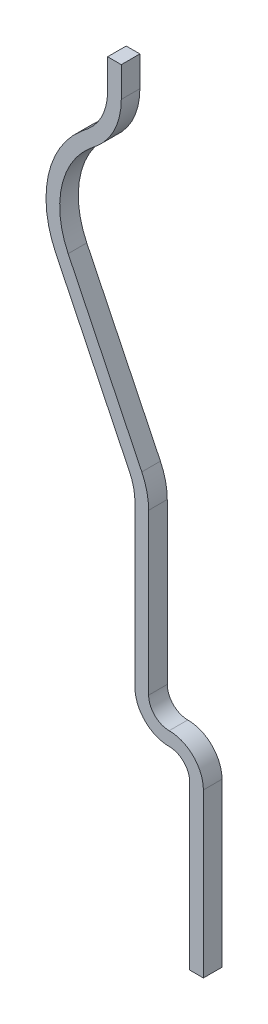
from build123d import *

# Parameters (mm, degrees)
PIN_EXTERNAL_BEND_DEPTH = 0.34


with BuildPart() as part:
    # Sketch1 → Pin External Bend (new body)
    with BuildSketch(Plane.XY):
        with BuildLine():
            Line((0.875, 0), (1.125, 0))
            Line((1.125, 0), (1.125, 2.975))
            ThreePointArc((1.125, 2.975), (0.941941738, 3.416941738), (0.5, 3.6))
            ThreePointArc((0.5, 3.6), (0.234834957, 3.709834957), (0.125, 3.975))
            Line((0.125, 3.975), (0.125, 6.9))
            ThreePointArc((0.125, 6.9), (0.093397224, 7.17929949), (0.000186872, 7.444476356))
            Line((0.000186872, 7.444476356), (-1.345231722, 10.224849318))
            ThreePointArc((-1.345231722, 10.224849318), (-1.46589081, 11.223380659), (-0.948252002, 12.085745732))
            Line((-0.948252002, 12.085745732), (-0.819958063, 12.193753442))
            ThreePointArc((-0.819958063, 12.193753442), (-0.491685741, 12.622649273), (-0.375, 13.15))
            Line((-0.375, 13.15), (-0.375, 13.7))
            Line((-0.375, 13.7), (-0.625, 13.7))
            Line((-0.625, 13.7), (-0.625, 13.15))
            ThreePointArc((-0.625, 13.15), (-0.718348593, 12.728119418), (-0.980966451, 12.385002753))
            Line((-0.980966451, 12.385002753), (-1.109260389, 12.276995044))
            ThreePointArc((-1.109260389, 12.276995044), (-1.710389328, 11.27553883), (-1.570269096, 10.115954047))
            Line((-1.570269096, 10.115954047), (-0.224850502, 7.335581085))
            ThreePointArc((-0.224850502, 7.335581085), (-0.150282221, 7.123439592), (-0.125, 6.9))
            Line((-0.125, 6.9), (-0.125, 3.975))
            ThreePointArc((-0.125, 3.975), (0.058058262, 3.533058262), (0.5, 3.35))
            ThreePointArc((0.5, 3.35), (0.765165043, 3.240165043), (0.875, 2.975))
            Line((0.875, 2.975), (0.875, 0))
        make_face()
    extrude(amount=PIN_EXTERNAL_BEND_DEPTH)


solid = part.part
